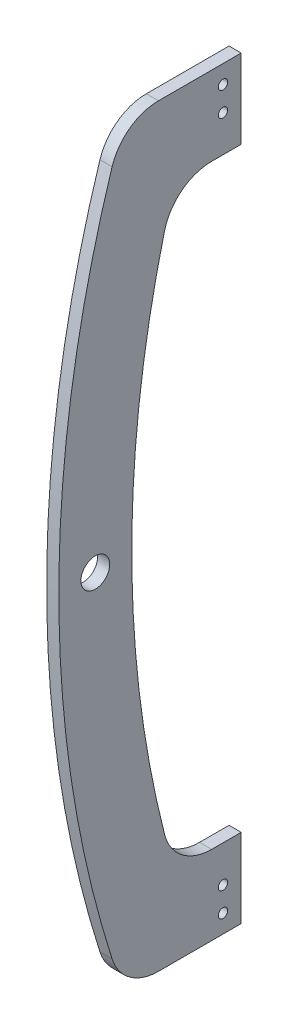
ISO-10303-21;
HEADER;
FILE_DESCRIPTION(('STEP AP214'),'2;1');
FILE_NAME('part.step','',(''),(''),'','','');
FILE_SCHEMA(('AUTOMOTIVE_DESIGN { 1 0 10303 214 1 1 1 1 }'));
ENDSEC;
DATA;
#1=APPLICATION_CONTEXT('core data for automotive mechanical design processes');
#2=APPLICATION_PROTOCOL_DEFINITION('international standard','automotive_design',2000,#1);
#3=PRODUCT_CONTEXT('',#1,'mechanical');
#4=PRODUCT('Part','Part','',(#3));
#5=PRODUCT_RELATED_PRODUCT_CATEGORY('part','',(#4));
#6=PRODUCT_DEFINITION_FORMATION('','',#4);
#7=PRODUCT_DEFINITION_CONTEXT('part definition',#1,'design');
#8=PRODUCT_DEFINITION('design','',#6,#7);
#9=PRODUCT_DEFINITION_SHAPE('','',#8);
#10=(LENGTH_UNIT() NAMED_UNIT(*) SI_UNIT(.MILLI.,.METRE.));
#11=(NAMED_UNIT(*) PLANE_ANGLE_UNIT() SI_UNIT($,.RADIAN.));
#12=(NAMED_UNIT(*) SI_UNIT($,.STERADIAN.) SOLID_ANGLE_UNIT());
#13=UNCERTAINTY_MEASURE_WITH_UNIT(LENGTH_MEASURE(1.E-05),#10,'distance_accuracy_value','');
#14=(GEOMETRIC_REPRESENTATION_CONTEXT(3) GLOBAL_UNCERTAINTY_ASSIGNED_CONTEXT((#13)) GLOBAL_UNIT_ASSIGNED_CONTEXT((#10,
#11,#12)) REPRESENTATION_CONTEXT('',''));
#15=CARTESIAN_POINT('',(0.,0.,0.));
#16=DIRECTION('',(0.,0.,1.));
#17=DIRECTION('',(1.,0.,0.));
#18=AXIS2_PLACEMENT_3D('',#15,#16,#17);
#19=CARTESIAN_POINT('',(12.7,-342.9,86.4318843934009));
#20=DIRECTION('',(-1.,0.,0.));
#21=DIRECTION('',(0.,0.,1.));
#22=AXIS2_PLACEMENT_3D('',#19,#20,#21);
#23=CYLINDRICAL_SURFACE('',#22,50.8000000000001);
#24=CARTESIAN_POINT('',(0.,-342.9,86.4318843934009));
#25=DIRECTION('',(1.,0.,0.));
#26=DIRECTION('',(0.,0.,-1.));
#27=AXIS2_PLACEMENT_3D('',#24,#25,#26);
#28=CIRCLE('',#27,50.8000000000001);
#29=CARTESIAN_POINT('',(0.,-358.311235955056,134.837811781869));
#30=VERTEX_POINT('',#29);
#31=CARTESIAN_POINT('',(0.,-393.7,86.4318843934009));
#32=VERTEX_POINT('',#31);
#33=EDGE_CURVE('E153',#30,#32,#28,.T.);
#34=ORIENTED_EDGE('',*,*,#33,.T.);
#35=DIRECTION('',(-1.,0.,0.));
#36=VECTOR('',#35,1.);
#37=CARTESIAN_POINT('',(12.7,-393.7,86.4318843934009));
#38=LINE('',#37,#36);
#39=CARTESIAN_POINT('',(12.7,-393.7,86.4318843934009));
#40=VERTEX_POINT('',#39);
#41=EDGE_CURVE('E11',#40,#32,#38,.T.);
#42=ORIENTED_EDGE('',*,*,#41,.F.);
#43=CARTESIAN_POINT('',(12.7,-342.9,86.4318843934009));
#44=DIRECTION('',(1.,0.,0.));
#45=DIRECTION('',(0.,0.,-1.));
#46=AXIS2_PLACEMENT_3D('',#43,#44,#45);
#47=CIRCLE('',#46,50.8000000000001);
#48=CARTESIAN_POINT('',(12.7,-358.311235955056,134.837811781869));
#49=VERTEX_POINT('',#48);
#50=EDGE_CURVE('E176',#49,#40,#47,.T.);
#51=ORIENTED_EDGE('',*,*,#50,.F.);
#52=DIRECTION('',(-1.,0.,0.));
#53=VECTOR('',#52,1.);
#54=CARTESIAN_POINT('',(12.7,-358.311235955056,134.837811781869));
#55=LINE('',#54,#53);
#56=EDGE_CURVE('E149',#49,#30,#55,.T.);
#57=ORIENTED_EDGE('',*,*,#56,.T.);
#58=EDGE_LOOP('',(#34,#42,#51,#57));
#59=FACE_BOUND('',#58,.T.);
#60=ADVANCED_FACE('F33',(#59),#23,.T.);
#61=CARTESIAN_POINT('',(12.7,-393.7,86.4318843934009));
#62=DIRECTION('',(0.,1.,0.));
#63=DIRECTION('',(0.,0.,1.));
#64=AXIS2_PLACEMENT_3D('',#61,#62,#63);
#65=PLANE('',#64);
#66=DIRECTION('',(0.,0.,-1.));
#67=VECTOR('',#66,1.);
#68=CARTESIAN_POINT('',(0.,-393.7,86.4318843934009));
#69=LINE('',#68,#67);
#70=CARTESIAN_POINT('',(0.,-393.7,0.));
#71=VERTEX_POINT('',#70);
#72=EDGE_CURVE('E156',#32,#71,#69,.T.);
#73=ORIENTED_EDGE('',*,*,#72,.T.);
#74=DIRECTION('',(-1.,0.,0.));
#75=VECTOR('',#74,1.);
#76=CARTESIAN_POINT('',(12.7,-393.7,0.));
#77=LINE('',#76,#75);
#78=CARTESIAN_POINT('',(12.7,-393.7,0.));
#79=VERTEX_POINT('',#78);
#80=EDGE_CURVE('E41',#79,#71,#77,.T.);
#81=ORIENTED_EDGE('',*,*,#80,.F.);
#82=DIRECTION('',(0.,0.,-1.));
#83=VECTOR('',#82,1.);
#84=CARTESIAN_POINT('',(12.7,-393.7,86.4318843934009));
#85=LINE('',#84,#83);
#86=EDGE_CURVE('E104',#40,#79,#85,.T.);
#87=ORIENTED_EDGE('',*,*,#86,.F.);
#88=ORIENTED_EDGE('',*,*,#41,.T.);
#89=EDGE_LOOP('',(#73,#81,#87,#88));
#90=FACE_BOUND('',#89,.T.);
#91=ADVANCED_FACE('F256',(#90),#65,.F.);
#92=CARTESIAN_POINT('',(12.7,-393.7,0.));
#93=DIRECTION('',(0.,0.,1.));
#94=DIRECTION('',(1.,0.,0.));
#95=AXIS2_PLACEMENT_3D('',#92,#93,#94);
#96=PLANE('',#95);
#97=DIRECTION('',(0.,1.,0.));
#98=VECTOR('',#97,1.);
#99=CARTESIAN_POINT('',(0.,-393.7,0.));
#100=LINE('',#99,#98);
#101=CARTESIAN_POINT('',(0.,-311.15,0.));
#102=VERTEX_POINT('',#101);
#103=EDGE_CURVE('E159',#71,#102,#100,.T.);
#104=ORIENTED_EDGE('',*,*,#103,.T.);
#105=DIRECTION('',(-1.,0.,0.));
#106=VECTOR('',#105,1.);
#107=CARTESIAN_POINT('',(12.7,-311.15,0.));
#108=LINE('',#107,#106);
#109=CARTESIAN_POINT('',(12.7,-311.15,0.));
#110=VERTEX_POINT('',#109);
#111=EDGE_CURVE('E195',#110,#102,#108,.T.);
#112=ORIENTED_EDGE('',*,*,#111,.F.);
#113=DIRECTION('',(0.,1.,0.));
#114=VECTOR('',#113,1.);
#115=CARTESIAN_POINT('',(12.7,-393.7,0.));
#116=LINE('',#115,#114);
#117=EDGE_CURVE('E203',#79,#110,#116,.T.);
#118=ORIENTED_EDGE('',*,*,#117,.F.);
#119=ORIENTED_EDGE('',*,*,#80,.T.);
#120=EDGE_LOOP('',(#104,#112,#118,#119));
#121=FACE_BOUND('',#120,.T.);
#122=ADVANCED_FACE('F201',(#121),#96,.F.);
#123=CARTESIAN_POINT('',(12.7,-311.15,0.));
#124=DIRECTION('',(0.,-1.,0.));
#125=DIRECTION('',(0.,0.,-1.));
#126=AXIS2_PLACEMENT_3D('',#123,#124,#125);
#127=PLANE('',#126);
#128=DIRECTION('',(0.,0.,1.));
#129=VECTOR('',#128,1.);
#130=CARTESIAN_POINT('',(0.,-311.15,0.));
#131=LINE('',#130,#129);
#132=CARTESIAN_POINT('',(0.,-311.15,30.8424543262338));
#133=VERTEX_POINT('',#132);
#134=EDGE_CURVE('E161',#102,#133,#131,.T.);
#135=ORIENTED_EDGE('',*,*,#134,.T.);
#136=DIRECTION('',(-1.,0.,0.));
#137=VECTOR('',#136,1.);
#138=CARTESIAN_POINT('',(12.7,-311.15,30.8424543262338));
#139=LINE('',#138,#137);
#140=CARTESIAN_POINT('',(12.7,-311.15,30.8424543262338));
#141=VERTEX_POINT('',#140);
#142=EDGE_CURVE('E192',#141,#133,#139,.T.);
#143=ORIENTED_EDGE('',*,*,#142,.F.);
#144=DIRECTION('',(0.,0.,1.));
#145=VECTOR('',#144,1.);
#146=CARTESIAN_POINT('',(12.7,-311.15,0.));
#147=LINE('',#146,#145);
#148=EDGE_CURVE('E221',#110,#141,#147,.T.);
#149=ORIENTED_EDGE('',*,*,#148,.F.);
#150=ORIENTED_EDGE('',*,*,#111,.T.);
#151=EDGE_LOOP('',(#135,#143,#149,#150));
#152=FACE_BOUND('',#151,.T.);
#153=ADVANCED_FACE('F212',(#152),#127,.F.);
#154=CARTESIAN_POINT('',(12.7,-260.35,30.8424543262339));
#155=DIRECTION('',(-1.,0.,0.));
#156=DIRECTION('',(0.,0.,1.));
#157=AXIS2_PLACEMENT_3D('',#154,#155,#156);
#158=CYLINDRICAL_SURFACE('',#157,50.7999999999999);
#159=CARTESIAN_POINT('',(0.,-260.35,30.8424543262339));
#160=DIRECTION('',(-1.,0.,0.));
#161=DIRECTION('',(0.,0.,-1.));
#162=AXIS2_PLACEMENT_3D('',#159,#160,#161);
#163=CIRCLE('',#162,50.7999999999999);
#164=CARTESIAN_POINT('',(0.,-272.896987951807,80.0685967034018));
#165=VERTEX_POINT('',#164);
#166=EDGE_CURVE('E163',#133,#165,#163,.T.);
#167=ORIENTED_EDGE('',*,*,#166,.T.);
#168=DIRECTION('',(-1.,0.,0.));
#169=VECTOR('',#168,1.);
#170=CARTESIAN_POINT('',(12.7,-272.896987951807,80.0685967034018));
#171=LINE('',#170,#169);
#172=CARTESIAN_POINT('',(12.7,-272.896987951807,80.0685967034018));
#173=VERTEX_POINT('',#172);
#174=EDGE_CURVE('E189',#173,#165,#171,.T.);
#175=ORIENTED_EDGE('',*,*,#174,.F.);
#176=CARTESIAN_POINT('',(12.7,-260.35,30.8424543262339));
#177=DIRECTION('',(-1.,0.,0.));
#178=DIRECTION('',(0.,0.,-1.));
#179=AXIS2_PLACEMENT_3D('',#176,#177,#178);
#180=CIRCLE('',#179,50.7999999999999);
#181=EDGE_CURVE('E218',#141,#173,#180,.T.);
#182=ORIENTED_EDGE('',*,*,#181,.F.);
#183=ORIENTED_EDGE('',*,*,#142,.T.);
#184=EDGE_LOOP('',(#167,#175,#182,#183));
#185=FACE_BOUND('',#184,.T.);
#186=ADVANCED_FACE('F216',(#185),#158,.F.);
#187=CARTESIAN_POINT('',(12.7,0.,-990.6));
#188=DIRECTION('',(-1.,0.,0.));
#189=DIRECTION('',(0.,0.,1.));
#190=AXIS2_PLACEMENT_3D('',#187,#188,#189);
#191=CYLINDRICAL_SURFACE('',#190,1104.9);
#192=CARTESIAN_POINT('',(0.,0.,-990.6));
#193=DIRECTION('',(-1.,0.,0.));
#194=DIRECTION('',(0.,0.,-1.));
#195=AXIS2_PLACEMENT_3D('',#192,#193,#194);
#196=CIRCLE('',#195,1104.9);
#197=CARTESIAN_POINT('',(0.,272.896987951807,80.0685967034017));
#198=VERTEX_POINT('',#197);
#199=EDGE_CURVE('E165',#165,#198,#196,.T.);
#200=ORIENTED_EDGE('',*,*,#199,.T.);
#201=DIRECTION('',(-1.,0.,0.));
#202=VECTOR('',#201,1.);
#203=CARTESIAN_POINT('',(12.7,272.896987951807,80.0685967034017));
#204=LINE('',#203,#202);
#205=CARTESIAN_POINT('',(12.7,272.896987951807,80.0685967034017));
#206=VERTEX_POINT('',#205);
#207=EDGE_CURVE('E186',#206,#198,#204,.T.);
#208=ORIENTED_EDGE('',*,*,#207,.F.);
#209=CARTESIAN_POINT('',(12.7,0.,-990.6));
#210=DIRECTION('',(-1.,0.,0.));
#211=DIRECTION('',(0.,0.,-1.));
#212=AXIS2_PLACEMENT_3D('',#209,#210,#211);
#213=CIRCLE('',#212,1104.9);
#214=EDGE_CURVE('E220',#173,#206,#213,.T.);
#215=ORIENTED_EDGE('',*,*,#214,.F.);
#216=ORIENTED_EDGE('',*,*,#174,.T.);
#217=EDGE_LOOP('',(#200,#208,#215,#216));
#218=FACE_BOUND('',#217,.T.);
#219=ADVANCED_FACE('F269',(#218),#191,.F.);
#220=CARTESIAN_POINT('',(12.7,260.35,30.8424543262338));
#221=DIRECTION('',(-1.,0.,0.));
#222=DIRECTION('',(0.,0.,1.));
#223=AXIS2_PLACEMENT_3D('',#220,#221,#222);
#224=CYLINDRICAL_SURFACE('',#223,50.8);
#225=CARTESIAN_POINT('',(0.,260.35,30.8424543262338));
#226=DIRECTION('',(-1.,0.,0.));
#227=DIRECTION('',(0.,0.,-1.));
#228=AXIS2_PLACEMENT_3D('',#225,#226,#227);
#229=CIRCLE('',#228,50.8);
#230=CARTESIAN_POINT('',(0.,311.15,30.8424543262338));
#231=VERTEX_POINT('',#230);
#232=EDGE_CURVE('E167',#198,#231,#229,.T.);
#233=ORIENTED_EDGE('',*,*,#232,.T.);
#234=DIRECTION('',(-1.,0.,0.));
#235=VECTOR('',#234,1.);
#236=CARTESIAN_POINT('',(12.7,311.15,30.8424543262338));
#237=LINE('',#236,#235);
#238=CARTESIAN_POINT('',(12.7,311.15,30.8424543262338));
#239=VERTEX_POINT('',#238);
#240=EDGE_CURVE('E183',#239,#231,#237,.T.);
#241=ORIENTED_EDGE('',*,*,#240,.F.);
#242=CARTESIAN_POINT('',(12.7,260.35,30.8424543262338));
#243=DIRECTION('',(-1.,0.,0.));
#244=DIRECTION('',(0.,0.,-1.));
#245=AXIS2_PLACEMENT_3D('',#242,#243,#244);
#246=CIRCLE('',#245,50.8);
#247=EDGE_CURVE('E223',#206,#239,#246,.T.);
#248=ORIENTED_EDGE('',*,*,#247,.F.);
#249=ORIENTED_EDGE('',*,*,#207,.T.);
#250=EDGE_LOOP('',(#233,#241,#248,#249));
#251=FACE_BOUND('',#250,.T.);
#252=ADVANCED_FACE('F272',(#251),#224,.F.);
#253=CARTESIAN_POINT('',(12.7,311.15,0.));
#254=DIRECTION('',(0.,1.,0.));
#255=DIRECTION('',(0.,0.,1.));
#256=AXIS2_PLACEMENT_3D('',#253,#254,#255);
#257=PLANE('',#256);
#258=DIRECTION('',(0.,0.,-1.));
#259=VECTOR('',#258,1.);
#260=CARTESIAN_POINT('',(0.,311.15,0.));
#261=LINE('',#260,#259);
#262=CARTESIAN_POINT('',(0.,311.15,0.));
#263=VERTEX_POINT('',#262);
#264=EDGE_CURVE('E169',#231,#263,#261,.T.);
#265=ORIENTED_EDGE('',*,*,#264,.T.);
#266=DIRECTION('',(-1.,0.,0.));
#267=VECTOR('',#266,1.);
#268=CARTESIAN_POINT('',(12.7,311.15,0.));
#269=LINE('',#268,#267);
#270=CARTESIAN_POINT('',(12.7,311.15,0.));
#271=VERTEX_POINT('',#270);
#272=EDGE_CURVE('E180',#271,#263,#269,.T.);
#273=ORIENTED_EDGE('',*,*,#272,.F.);
#274=DIRECTION('',(0.,0.,-1.));
#275=VECTOR('',#274,1.);
#276=CARTESIAN_POINT('',(12.7,311.15,0.));
#277=LINE('',#276,#275);
#278=EDGE_CURVE('E229',#239,#271,#277,.T.);
#279=ORIENTED_EDGE('',*,*,#278,.F.);
#280=ORIENTED_EDGE('',*,*,#240,.T.);
#281=EDGE_LOOP('',(#265,#273,#279,#280));
#282=FACE_BOUND('',#281,.T.);
#283=ADVANCED_FACE('F235',(#282),#257,.F.);
#284=CARTESIAN_POINT('',(12.7,393.7,0.));
#285=DIRECTION('',(0.,0.,1.));
#286=DIRECTION('',(0.,-1.,0.));
#287=AXIS2_PLACEMENT_3D('',#284,#285,#286);
#288=PLANE('',#287);
#289=DIRECTION('',(0.,1.,0.));
#290=VECTOR('',#289,1.);
#291=CARTESIAN_POINT('',(0.,393.7,0.));
#292=LINE('',#291,#290);
#293=CARTESIAN_POINT('',(0.,393.7,0.));
#294=VERTEX_POINT('',#293);
#295=EDGE_CURVE('E171',#263,#294,#292,.T.);
#296=ORIENTED_EDGE('',*,*,#295,.T.);
#297=DIRECTION('',(-1.,0.,0.));
#298=VECTOR('',#297,1.);
#299=CARTESIAN_POINT('',(12.7,393.7,0.));
#300=LINE('',#299,#298);
#301=CARTESIAN_POINT('',(12.7,393.7,0.));
#302=VERTEX_POINT('',#301);
#303=EDGE_CURVE('E144',#302,#294,#300,.T.);
#304=ORIENTED_EDGE('',*,*,#303,.F.);
#305=DIRECTION('',(0.,1.,0.));
#306=VECTOR('',#305,1.);
#307=CARTESIAN_POINT('',(12.7,393.7,0.));
#308=LINE('',#307,#306);
#309=EDGE_CURVE('E135',#271,#302,#308,.T.);
#310=ORIENTED_EDGE('',*,*,#309,.F.);
#311=ORIENTED_EDGE('',*,*,#272,.T.);
#312=EDGE_LOOP('',(#296,#304,#310,#311));
#313=FACE_BOUND('',#312,.T.);
#314=ADVANCED_FACE('F239',(#313),#288,.F.);
#315=CARTESIAN_POINT('',(12.7,393.7,86.4318843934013));
#316=DIRECTION('',(0.,-1.,0.));
#317=DIRECTION('',(0.,0.,-1.));
#318=AXIS2_PLACEMENT_3D('',#315,#316,#317);
#319=PLANE('',#318);
#320=DIRECTION('',(0.,0.,1.));
#321=VECTOR('',#320,1.);
#322=CARTESIAN_POINT('',(0.,393.7,86.4318843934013));
#323=LINE('',#322,#321);
#324=CARTESIAN_POINT('',(0.,393.7,86.4318843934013));
#325=VERTEX_POINT('',#324);
#326=EDGE_CURVE('E143',#294,#325,#323,.T.);
#327=ORIENTED_EDGE('',*,*,#326,.T.);
#328=DIRECTION('',(-1.,0.,0.));
#329=VECTOR('',#328,1.);
#330=CARTESIAN_POINT('',(12.7,393.7,86.4318843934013));
#331=LINE('',#330,#329);
#332=CARTESIAN_POINT('',(12.7,393.7,86.4318843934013));
#333=VERTEX_POINT('',#332);
#334=EDGE_CURVE('E140',#333,#325,#331,.T.);
#335=ORIENTED_EDGE('',*,*,#334,.F.);
#336=DIRECTION('',(0.,0.,1.));
#337=VECTOR('',#336,1.);
#338=CARTESIAN_POINT('',(12.7,393.7,86.4318843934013));
#339=LINE('',#338,#337);
#340=EDGE_CURVE('E129',#302,#333,#339,.T.);
#341=ORIENTED_EDGE('',*,*,#340,.F.);
#342=ORIENTED_EDGE('',*,*,#303,.T.);
#343=EDGE_LOOP('',(#327,#335,#341,#342));
#344=FACE_BOUND('',#343,.T.);
#345=ADVANCED_FACE('F141',(#344),#319,.F.);
#346=CARTESIAN_POINT('',(12.7,342.9,86.4318843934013));
#347=DIRECTION('',(-1.,0.,0.));
#348=DIRECTION('',(0.,0.,1.));
#349=AXIS2_PLACEMENT_3D('',#346,#347,#348);
#350=CYLINDRICAL_SURFACE('',#349,50.7999999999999);
#351=CARTESIAN_POINT('',(0.,342.9,86.4318843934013));
#352=DIRECTION('',(1.,0.,0.));
#353=DIRECTION('',(0.,0.,1.));
#354=AXIS2_PLACEMENT_3D('',#351,#352,#353);
#355=CIRCLE('',#354,50.7999999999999);
#356=CARTESIAN_POINT('',(0.,358.311235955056,134.837811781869));
#357=VERTEX_POINT('',#356);
#358=EDGE_CURVE('E90',#325,#357,#355,.T.);
#359=ORIENTED_EDGE('',*,*,#358,.T.);
#360=DIRECTION('',(-1.,0.,0.));
#361=VECTOR('',#360,1.);
#362=CARTESIAN_POINT('',(12.7,358.311235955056,134.837811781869));
#363=LINE('',#362,#361);
#364=CARTESIAN_POINT('',(12.7,358.311235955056,134.837811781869));
#365=VERTEX_POINT('',#364);
#366=EDGE_CURVE('E145',#365,#357,#363,.T.);
#367=ORIENTED_EDGE('',*,*,#366,.F.);
#368=CARTESIAN_POINT('',(12.7,342.9,86.4318843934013));
#369=DIRECTION('',(1.,0.,0.));
#370=DIRECTION('',(0.,0.,1.));
#371=AXIS2_PLACEMENT_3D('',#368,#369,#370);
#372=CIRCLE('',#371,50.7999999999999);
#373=EDGE_CURVE('E133',#333,#365,#372,.T.);
#374=ORIENTED_EDGE('',*,*,#373,.F.);
#375=ORIENTED_EDGE('',*,*,#334,.T.);
#376=EDGE_LOOP('',(#359,#367,#374,#375));
#377=FACE_BOUND('',#376,.T.);
#378=ADVANCED_FACE('F147',(#377),#350,.T.);
#379=CARTESIAN_POINT('',(12.7,0.,-990.6));
#380=DIRECTION('',(-1.,0.,0.));
#381=DIRECTION('',(0.,0.,1.));
#382=AXIS2_PLACEMENT_3D('',#379,#380,#381);
#383=CYLINDRICAL_SURFACE('',#382,1181.1);
#384=CARTESIAN_POINT('',(0.,0.,-990.6));
#385=DIRECTION('',(1.,0.,0.));
#386=DIRECTION('',(0.,0.,-1.));
#387=AXIS2_PLACEMENT_3D('',#384,#385,#386);
#388=CIRCLE('',#387,1181.1);
#389=EDGE_CURVE('E96',#357,#30,#388,.T.);
#390=ORIENTED_EDGE('',*,*,#389,.T.);
#391=ORIENTED_EDGE('',*,*,#56,.F.);
#392=CARTESIAN_POINT('',(12.7,0.,-990.6));
#393=DIRECTION('',(1.,0.,0.));
#394=DIRECTION('',(0.,0.,-1.));
#395=AXIS2_PLACEMENT_3D('',#392,#393,#394);
#396=CIRCLE('',#395,1181.1);
#397=EDGE_CURVE('E49',#365,#49,#396,.T.);
#398=ORIENTED_EDGE('',*,*,#397,.F.);
#399=ORIENTED_EDGE('',*,*,#366,.T.);
#400=EDGE_LOOP('',(#390,#391,#398,#399));
#401=FACE_BOUND('',#400,.T.);
#402=ADVANCED_FACE('F243',(#401),#383,.T.);
#403=CARTESIAN_POINT('',(12.7,-342.9,86.4318843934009));
#404=DIRECTION('',(1.,0.,0.));
#405=DIRECTION('',(0.,0.,-1.));
#406=AXIS2_PLACEMENT_3D('',#403,#404,#405);
#407=PLANE('',#406);
#408=CARTESIAN_POINT('',(12.7,-349.25,19.05));
#409=DIRECTION('',(1.,0.,0.));
#410=DIRECTION('',(0.,0.,-1.));
#411=AXIS2_PLACEMENT_3D('',#408,#409,#410);
#412=CIRCLE('',#411,4.90219999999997);
#413=CARTESIAN_POINT('',(12.7,-349.25,14.1478));
#414=VERTEX_POINT('',#413);
#415=EDGE_CURVE('E363',#414,#414,#412,.T.);
#416=ORIENTED_EDGE('',*,*,#415,.F.);
#417=EDGE_LOOP('',(#416));
#418=FACE_BOUND('',#417,.T.);
#419=CARTESIAN_POINT('',(12.7,-374.65,19.05));
#420=DIRECTION('',(1.,0.,0.));
#421=DIRECTION('',(0.,0.,-1.));
#422=AXIS2_PLACEMENT_3D('',#419,#420,#421);
#423=CIRCLE('',#422,4.90219999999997);
#424=CARTESIAN_POINT('',(12.7,-374.65,14.1478));
#425=VERTEX_POINT('',#424);
#426=EDGE_CURVE('E365',#425,#425,#423,.T.);
#427=ORIENTED_EDGE('',*,*,#426,.F.);
#428=EDGE_LOOP('',(#427));
#429=FACE_BOUND('',#428,.T.);
#430=CARTESIAN_POINT('',(12.7,349.25,19.05));
#431=DIRECTION('',(1.,0.,0.));
#432=DIRECTION('',(0.,0.,-1.));
#433=AXIS2_PLACEMENT_3D('',#430,#431,#432);
#434=CIRCLE('',#433,4.90219999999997);
#435=CARTESIAN_POINT('',(12.7,349.25,14.1478));
#436=VERTEX_POINT('',#435);
#437=EDGE_CURVE('E373',#436,#436,#434,.T.);
#438=ORIENTED_EDGE('',*,*,#437,.F.);
#439=EDGE_LOOP('',(#438));
#440=FACE_BOUND('',#439,.T.);
#441=CARTESIAN_POINT('',(12.7,374.65,19.05));
#442=DIRECTION('',(1.,0.,0.));
#443=DIRECTION('',(0.,0.,-1.));
#444=AXIS2_PLACEMENT_3D('',#441,#442,#443);
#445=CIRCLE('',#444,4.90219999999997);
#446=CARTESIAN_POINT('',(12.7,374.65,14.1478));
#447=VERTEX_POINT('',#446);
#448=EDGE_CURVE('E379',#447,#447,#445,.T.);
#449=ORIENTED_EDGE('',*,*,#448,.F.);
#450=EDGE_LOOP('',(#449));
#451=FACE_BOUND('',#450,.T.);
#452=CARTESIAN_POINT('',(12.7,0.,152.4));
#453=DIRECTION('',(1.,0.,0.));
#454=DIRECTION('',(0.,0.,-1.));
#455=AXIS2_PLACEMENT_3D('',#452,#453,#454);
#456=CIRCLE('',#455,15.08125);
#457=CARTESIAN_POINT('',(12.7,0.,137.31875));
#458=VERTEX_POINT('',#457);
#459=EDGE_CURVE('E385',#458,#458,#456,.T.);
#460=ORIENTED_EDGE('',*,*,#459,.F.);
#461=EDGE_LOOP('',(#460));
#462=FACE_BOUND('',#461,.T.);
#463=ORIENTED_EDGE('',*,*,#50,.T.);
#464=ORIENTED_EDGE('',*,*,#86,.T.);
#465=ORIENTED_EDGE('',*,*,#117,.T.);
#466=ORIENTED_EDGE('',*,*,#148,.T.);
#467=ORIENTED_EDGE('',*,*,#181,.T.);
#468=ORIENTED_EDGE('',*,*,#214,.T.);
#469=ORIENTED_EDGE('',*,*,#247,.T.);
#470=ORIENTED_EDGE('',*,*,#278,.T.);
#471=ORIENTED_EDGE('',*,*,#309,.T.);
#472=ORIENTED_EDGE('',*,*,#340,.T.);
#473=ORIENTED_EDGE('',*,*,#373,.T.);
#474=ORIENTED_EDGE('',*,*,#397,.T.);
#475=EDGE_LOOP('',(#463,#464,#465,#466,#467,#468,#469,#470,#471,#472,#473,#474));
#476=FACE_BOUND('',#475,.T.);
#477=ADVANCED_FACE('F131',(#418,#429,#440,#451,#462,#476),#407,.T.);
#478=CARTESIAN_POINT('',(0.,-342.9,86.4318843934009));
#479=DIRECTION('',(1.,0.,0.));
#480=DIRECTION('',(0.,0.,-1.));
#481=AXIS2_PLACEMENT_3D('',#478,#479,#480);
#482=PLANE('',#481);
#483=CARTESIAN_POINT('',(0.,-349.25,19.05));
#484=DIRECTION('',(1.,0.,0.));
#485=DIRECTION('',(0.,0.,-1.));
#486=AXIS2_PLACEMENT_3D('',#483,#484,#485);
#487=CIRCLE('',#486,4.90220000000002);
#488=CARTESIAN_POINT('',(0.,-349.25,14.1478));
#489=VERTEX_POINT('',#488);
#490=EDGE_CURVE('E360',#489,#489,#487,.T.);
#491=ORIENTED_EDGE('',*,*,#490,.T.);
#492=EDGE_LOOP('',(#491));
#493=FACE_BOUND('',#492,.T.);
#494=CARTESIAN_POINT('',(0.,-374.65,19.05));
#495=DIRECTION('',(1.,0.,0.));
#496=DIRECTION('',(0.,0.,-1.));
#497=AXIS2_PLACEMENT_3D('',#494,#495,#496);
#498=CIRCLE('',#497,4.90220000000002);
#499=CARTESIAN_POINT('',(0.,-374.65,14.1478));
#500=VERTEX_POINT('',#499);
#501=EDGE_CURVE('E370',#500,#500,#498,.T.);
#502=ORIENTED_EDGE('',*,*,#501,.T.);
#503=EDGE_LOOP('',(#502));
#504=FACE_BOUND('',#503,.T.);
#505=CARTESIAN_POINT('',(0.,349.25,19.05));
#506=DIRECTION('',(1.,0.,0.));
#507=DIRECTION('',(0.,0.,-1.));
#508=AXIS2_PLACEMENT_3D('',#505,#506,#507);
#509=CIRCLE('',#508,4.90220000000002);
#510=CARTESIAN_POINT('',(0.,349.25,14.1478));
#511=VERTEX_POINT('',#510);
#512=EDGE_CURVE('E376',#511,#511,#509,.T.);
#513=ORIENTED_EDGE('',*,*,#512,.T.);
#514=EDGE_LOOP('',(#513));
#515=FACE_BOUND('',#514,.T.);
#516=CARTESIAN_POINT('',(0.,374.65,19.05));
#517=DIRECTION('',(1.,0.,0.));
#518=DIRECTION('',(0.,0.,-1.));
#519=AXIS2_PLACEMENT_3D('',#516,#517,#518);
#520=CIRCLE('',#519,4.90220000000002);
#521=CARTESIAN_POINT('',(0.,374.65,14.1478));
#522=VERTEX_POINT('',#521);
#523=EDGE_CURVE('E382',#522,#522,#520,.T.);
#524=ORIENTED_EDGE('',*,*,#523,.T.);
#525=EDGE_LOOP('',(#524));
#526=FACE_BOUND('',#525,.T.);
#527=CARTESIAN_POINT('',(0.,0.,152.4));
#528=DIRECTION('',(1.,0.,0.));
#529=DIRECTION('',(0.,0.,-1.));
#530=AXIS2_PLACEMENT_3D('',#527,#528,#529);
#531=CIRCLE('',#530,15.08125);
#532=CARTESIAN_POINT('',(0.,0.,137.31875));
#533=VERTEX_POINT('',#532);
#534=EDGE_CURVE('E157',#533,#533,#531,.T.);
#535=ORIENTED_EDGE('',*,*,#534,.T.);
#536=EDGE_LOOP('',(#535));
#537=FACE_BOUND('',#536,.T.);
#538=ORIENTED_EDGE('',*,*,#33,.F.);
#539=ORIENTED_EDGE('',*,*,#389,.F.);
#540=ORIENTED_EDGE('',*,*,#358,.F.);
#541=ORIENTED_EDGE('',*,*,#326,.F.);
#542=ORIENTED_EDGE('',*,*,#295,.F.);
#543=ORIENTED_EDGE('',*,*,#264,.F.);
#544=ORIENTED_EDGE('',*,*,#232,.F.);
#545=ORIENTED_EDGE('',*,*,#199,.F.);
#546=ORIENTED_EDGE('',*,*,#166,.F.);
#547=ORIENTED_EDGE('',*,*,#134,.F.);
#548=ORIENTED_EDGE('',*,*,#103,.F.);
#549=ORIENTED_EDGE('',*,*,#72,.F.);
#550=EDGE_LOOP('',(#538,#539,#540,#541,#542,#543,#544,#545,#546,#547,#548,#549));
#551=FACE_BOUND('',#550,.T.);
#552=ADVANCED_FACE('F207',(#493,#504,#515,#526,#537,#551),#482,.F.);
#553=CARTESIAN_POINT('',(0.,0.,152.4));
#554=DIRECTION('',(1.,0.,0.));
#555=DIRECTION('',(0.,0.,-1.));
#556=AXIS2_PLACEMENT_3D('',#553,#554,#555);
#557=CYLINDRICAL_SURFACE('',#556,15.08125);
#558=ORIENTED_EDGE('',*,*,#534,.F.);
#559=EDGE_LOOP('',(#558));
#560=FACE_BOUND('',#559,.T.);
#561=ORIENTED_EDGE('',*,*,#459,.T.);
#562=EDGE_LOOP('',(#561));
#563=FACE_BOUND('',#562,.T.);
#564=ADVANCED_FACE('F300',(#560,#563),#557,.F.);
#565=CARTESIAN_POINT('',(12.7,374.65,19.05));
#566=DIRECTION('',(1.,0.,0.));
#567=DIRECTION('',(0.,0.,-1.));
#568=AXIS2_PLACEMENT_3D('',#565,#566,#567);
#569=CYLINDRICAL_SURFACE('',#568,4.9022);
#570=ORIENTED_EDGE('',*,*,#523,.F.);
#571=EDGE_LOOP('',(#570));
#572=FACE_BOUND('',#571,.T.);
#573=ORIENTED_EDGE('',*,*,#448,.T.);
#574=EDGE_LOOP('',(#573));
#575=FACE_BOUND('',#574,.T.);
#576=ADVANCED_FACE('F304',(#572,#575),#569,.F.);
#577=CARTESIAN_POINT('',(12.7,349.25,19.05));
#578=DIRECTION('',(1.,0.,0.));
#579=DIRECTION('',(0.,0.,-1.));
#580=AXIS2_PLACEMENT_3D('',#577,#578,#579);
#581=CYLINDRICAL_SURFACE('',#580,4.9022);
#582=ORIENTED_EDGE('',*,*,#512,.F.);
#583=EDGE_LOOP('',(#582));
#584=FACE_BOUND('',#583,.T.);
#585=ORIENTED_EDGE('',*,*,#437,.T.);
#586=EDGE_LOOP('',(#585));
#587=FACE_BOUND('',#586,.T.);
#588=ADVANCED_FACE('F323',(#584,#587),#581,.F.);
#589=CARTESIAN_POINT('',(12.7,-374.65,19.05));
#590=DIRECTION('',(1.,0.,0.));
#591=DIRECTION('',(0.,0.,-1.));
#592=AXIS2_PLACEMENT_3D('',#589,#590,#591);
#593=CYLINDRICAL_SURFACE('',#592,4.9022);
#594=ORIENTED_EDGE('',*,*,#501,.F.);
#595=EDGE_LOOP('',(#594));
#596=FACE_BOUND('',#595,.T.);
#597=ORIENTED_EDGE('',*,*,#426,.T.);
#598=EDGE_LOOP('',(#597));
#599=FACE_BOUND('',#598,.T.);
#600=ADVANCED_FACE('F333',(#596,#599),#593,.F.);
#601=CARTESIAN_POINT('',(12.7,-349.25,19.05));
#602=DIRECTION('',(1.,0.,0.));
#603=DIRECTION('',(0.,0.,-1.));
#604=AXIS2_PLACEMENT_3D('',#601,#602,#603);
#605=CYLINDRICAL_SURFACE('',#604,4.9022);
#606=ORIENTED_EDGE('',*,*,#490,.F.);
#607=EDGE_LOOP('',(#606));
#608=FACE_BOUND('',#607,.T.);
#609=ORIENTED_EDGE('',*,*,#415,.T.);
#610=EDGE_LOOP('',(#609));
#611=FACE_BOUND('',#610,.T.);
#612=ADVANCED_FACE('F343',(#608,#611),#605,.F.);
#613=CLOSED_SHELL('',(#60,#91,#122,#153,#186,#219,#252,#283,#314,#345,#378,#402,#477,#552,#564,
#576,#588,#600,#612));
#614=MANIFOLD_SOLID_BREP('B2',#613);
#615=ADVANCED_BREP_SHAPE_REPRESENTATION('',(#18,#614),#14);
#616=SHAPE_DEFINITION_REPRESENTATION(#9,#615);
ENDSEC;
END-ISO-10303-21;
